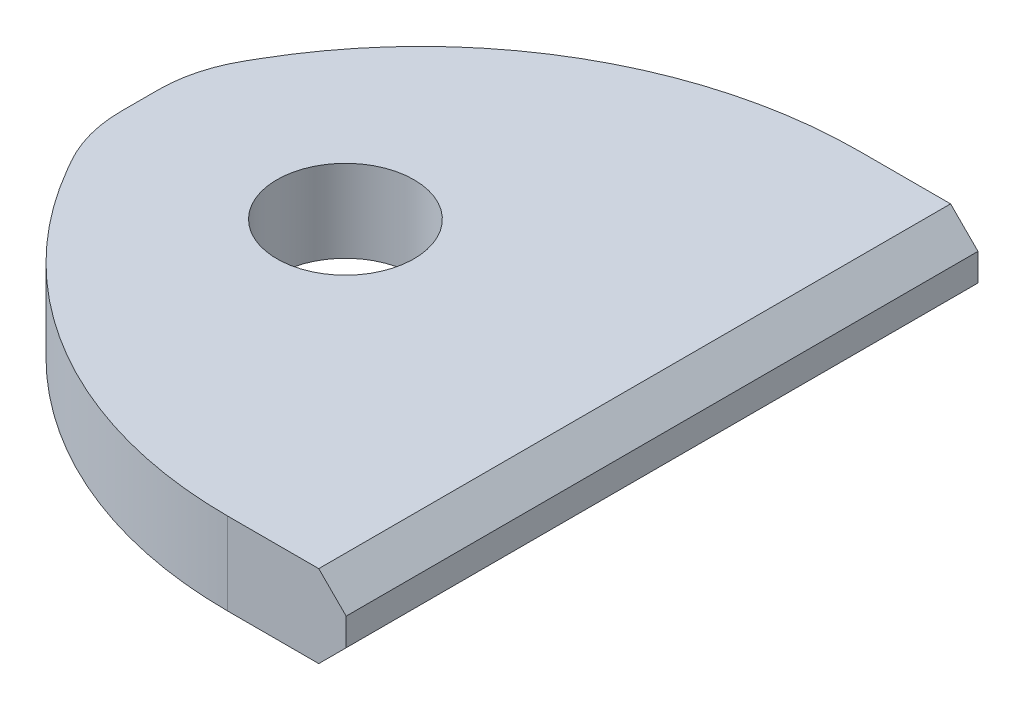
from build123d import *

# Parameters (mm, degrees)
SKETCH1_R           = 7.9375
BOSS_EXTRUDE1_DEPTH = 4.7625
CHAMFER1_SIZE       = 3.175


with BuildPart() as part:
    # Sketch1 → Boss-Extrude1 (new, symmetric)
    with BuildSketch(Plane(origin=(0, 0, 0), x_dir=(1, 0, 0), z_dir=(0, 1, 0))):
        with BuildLine():
            Line((36.66109, 36.576), (36.66109, -36.576))
            Line((36.66109, -36.576), (22.950250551, -36.576))
            ThreePointArc((22.950250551, -36.576), (-2.449749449, -29.770090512), (-21.043839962, -11.176))
            Line((-21.043839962, -11.176), (-21.685653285, -10.064346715))
            ThreePointArc((-21.685653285, -10.064346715), (-23.271572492, -6.235599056), (-23.8125, -2.126846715))
            Line((-23.8125, -2.126846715), (-23.8125, 2.126846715))
            ThreePointArc((-23.8125, 2.126846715), (-23.271572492, 6.235599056), (-21.685653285, 10.064346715))
            Line((-21.685653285, 10.064346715), (-21.043839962, 11.176))
            ThreePointArc((-21.043839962, 11.176), (-2.449749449, 29.770090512), (22.950250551, 36.576))
            Line((22.950250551, 36.576), (36.66109, 36.576))
        make_face()
        with Locations(Location((0, 0, 0), (0, 0, 90))):
            Circle(SKETCH1_R, mode=Mode.SUBTRACT)
    extrude(amount=BOSS_EXTRUDE1_DEPTH, both=True)

    # Chamfer1
    chamfer1_edges = [part.edges().sort_by_distance(p)[0] for p in [
        (36.66109, -4.7625, 0),
        (36.66109, 4.7625, 0),
    ]]
    chamfer(chamfer1_edges, length=CHAMFER1_SIZE)


solid = part.part
